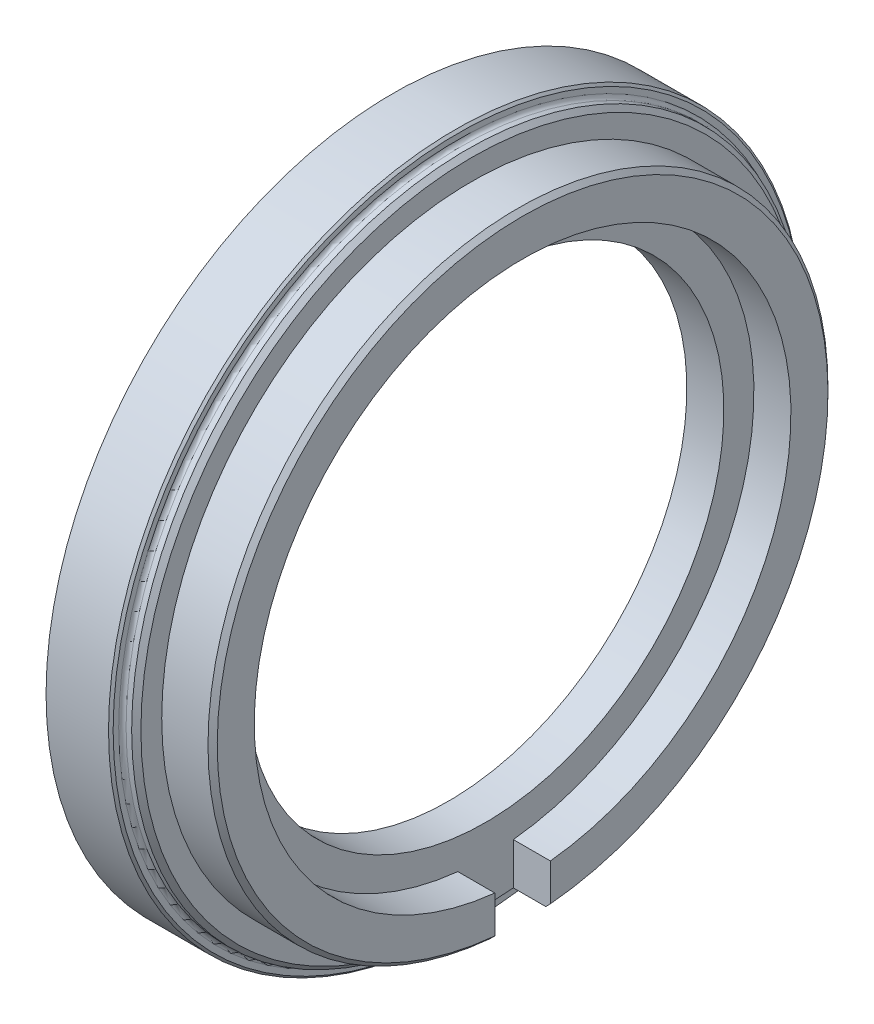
ISO-10303-21;
HEADER;
FILE_DESCRIPTION(('STEP AP214'),'2;1');
FILE_NAME('part.step','',(''),(''),'','','');
FILE_SCHEMA(('AUTOMOTIVE_DESIGN { 1 0 10303 214 1 1 1 1 }'));
ENDSEC;
DATA;
#1=APPLICATION_CONTEXT('core data for automotive mechanical design processes');
#2=APPLICATION_PROTOCOL_DEFINITION('international standard','automotive_design',2000,#1);
#3=PRODUCT_CONTEXT('',#1,'mechanical');
#4=PRODUCT('Part','Part','',(#3));
#5=PRODUCT_RELATED_PRODUCT_CATEGORY('part','',(#4));
#6=PRODUCT_DEFINITION_FORMATION('','',#4);
#7=PRODUCT_DEFINITION_CONTEXT('part definition',#1,'design');
#8=PRODUCT_DEFINITION('design','',#6,#7);
#9=PRODUCT_DEFINITION_SHAPE('','',#8);
#10=(LENGTH_UNIT() NAMED_UNIT(*) SI_UNIT(.MILLI.,.METRE.));
#11=(NAMED_UNIT(*) PLANE_ANGLE_UNIT() SI_UNIT($,.RADIAN.));
#12=(NAMED_UNIT(*) SI_UNIT($,.STERADIAN.) SOLID_ANGLE_UNIT());
#13=UNCERTAINTY_MEASURE_WITH_UNIT(LENGTH_MEASURE(1.E-05),#10,'distance_accuracy_value','');
#14=(GEOMETRIC_REPRESENTATION_CONTEXT(3) GLOBAL_UNCERTAINTY_ASSIGNED_CONTEXT((#13)) GLOBAL_UNIT_ASSIGNED_CONTEXT((#10,
#11,#12)) REPRESENTATION_CONTEXT('',''));
#15=CARTESIAN_POINT('',(0.,0.,0.));
#16=DIRECTION('',(0.,0.,1.));
#17=DIRECTION('',(1.,0.,0.));
#18=AXIS2_PLACEMENT_3D('',#15,#16,#17);
#19=CARTESIAN_POINT('',(0.,0.,0.));
#20=DIRECTION('',(-1.,0.,0.));
#21=DIRECTION('',(0.,0.,1.));
#22=AXIS2_PLACEMENT_3D('',#19,#20,#21);
#23=CYLINDRICAL_SURFACE('',#22,36.25);
#24=CARTESIAN_POINT('',(8.99999999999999,0.,0.));
#25=DIRECTION('',(-1.,0.,0.));
#26=DIRECTION('',(0.,0.,1.));
#27=AXIS2_PLACEMENT_3D('',#24,#25,#26);
#28=CIRCLE('',#27,36.25);
#29=CARTESIAN_POINT('',(8.99999999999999,0.,36.25));
#30=VERTEX_POINT('',#29);
#31=EDGE_CURVE('E94',#30,#30,#28,.F.);
#32=ORIENTED_EDGE('',*,*,#31,.F.);
#33=EDGE_LOOP('',(#32));
#34=FACE_BOUND('',#33,.T.);
#35=CARTESIAN_POINT('',(8.39999999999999,0.,0.));
#36=DIRECTION('',(-1.,0.,0.));
#37=DIRECTION('',(0.,0.,1.));
#38=AXIS2_PLACEMENT_3D('',#35,#36,#37);
#39=CIRCLE('',#38,36.25);
#40=CARTESIAN_POINT('',(8.39999999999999,0.,36.25));
#41=VERTEX_POINT('',#40);
#42=EDGE_CURVE('E340',#41,#41,#39,.F.);
#43=ORIENTED_EDGE('',*,*,#42,.T.);
#44=EDGE_LOOP('',(#43));
#45=FACE_BOUND('',#44,.T.);
#46=ADVANCED_FACE('F16',(#34,#45),#23,.T.);
#47=CARTESIAN_POINT('',(8.39999999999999,0.,0.));
#48=DIRECTION('',(-1.,0.,0.));
#49=DIRECTION('',(0.,0.,1.));
#50=AXIS2_PLACEMENT_3D('',#47,#48,#49);
#51=TOROIDAL_SURFACE('',#50,36.65,0.4);
#52=CARTESIAN_POINT('',(7.99999999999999,0.,0.));
#53=DIRECTION('',(1.,0.,0.));
#54=DIRECTION('',(0.,0.,-1.));
#55=AXIS2_PLACEMENT_3D('',#52,#53,#54);
#56=CIRCLE('',#55,36.65);
#57=CARTESIAN_POINT('',(7.99999999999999,0.,-36.65));
#58=VERTEX_POINT('',#57);
#59=CARTESIAN_POINT('',(7.99999999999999,0.,36.65));
#60=VERTEX_POINT('',#59);
#61=EDGE_CURVE('E87',#58,#60,#56,.T.);
#62=ORIENTED_EDGE('',*,*,#61,.T.);
#63=CARTESIAN_POINT('',(7.99999999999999,0.,0.));
#64=DIRECTION('',(1.,0.,0.));
#65=DIRECTION('',(0.,0.,1.));
#66=AXIS2_PLACEMENT_3D('',#63,#64,#65);
#67=CIRCLE('',#66,36.65);
#68=EDGE_CURVE('E90',#60,#58,#67,.T.);
#69=ORIENTED_EDGE('',*,*,#68,.T.);
#70=EDGE_LOOP('',(#62,#69));
#71=FACE_BOUND('',#70,.T.);
#72=ORIENTED_EDGE('',*,*,#42,.F.);
#73=EDGE_LOOP('',(#72));
#74=FACE_BOUND('',#73,.T.);
#75=ADVANCED_FACE('F98',(#71,#74),#51,.F.);
#76=CARTESIAN_POINT('',(8.99999999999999,0.,0.));
#77=DIRECTION('',(-1.,0.,0.));
#78=DIRECTION('',(0.,0.,1.));
#79=AXIS2_PLACEMENT_3D('',#76,#77,#78);
#80=CONICAL_SURFACE('',#79,36.25,0.78539816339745);
#81=CARTESIAN_POINT('',(9.49999999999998,0.,0.));
#82=DIRECTION('',(-1.,0.,0.));
#83=DIRECTION('',(0.,0.,1.));
#84=AXIS2_PLACEMENT_3D('',#81,#82,#83);
#85=CIRCLE('',#84,35.75);
#86=CARTESIAN_POINT('',(9.49999999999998,0.,35.75));
#87=VERTEX_POINT('',#86);
#88=EDGE_CURVE('E261',#87,#87,#85,.T.);
#89=ORIENTED_EDGE('',*,*,#88,.T.);
#90=EDGE_LOOP('',(#89));
#91=FACE_BOUND('',#90,.T.);
#92=ORIENTED_EDGE('',*,*,#31,.T.);
#93=EDGE_LOOP('',(#92));
#94=FACE_BOUND('',#93,.T.);
#95=ADVANCED_FACE('F116',(#91,#94),#80,.T.);
#96=CARTESIAN_POINT('',(7.99999999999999,36.25,0.));
#97=DIRECTION('',(-1.,0.,0.));
#98=DIRECTION('',(0.,0.,1.));
#99=AXIS2_PLACEMENT_3D('',#96,#97,#98);
#100=PLANE('',#99);
#101=CARTESIAN_POINT('',(7.99999999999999,0.,0.));
#102=DIRECTION('',(-1.,0.,0.));
#103=DIRECTION('',(0.,0.,1.));
#104=AXIS2_PLACEMENT_3D('',#101,#102,#103);
#105=CIRCLE('',#104,37.25);
#106=CARTESIAN_POINT('',(7.99999999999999,0.,37.25));
#107=VERTEX_POINT('',#106);
#108=EDGE_CURVE('E257',#107,#107,#105,.T.);
#109=ORIENTED_EDGE('',*,*,#108,.F.);
#110=EDGE_LOOP('',(#109));
#111=FACE_BOUND('',#110,.T.);
#112=ORIENTED_EDGE('',*,*,#68,.F.);
#113=ORIENTED_EDGE('',*,*,#61,.F.);
#114=EDGE_LOOP('',(#112,#113));
#115=FACE_BOUND('',#114,.T.);
#116=ADVANCED_FACE('F92',(#111,#115),#100,.F.);
#117=CARTESIAN_POINT('',(14.5,0.,0.));
#118=DIRECTION('',(-1.,0.,0.));
#119=DIRECTION('',(0.,0.,1.));
#120=AXIS2_PLACEMENT_3D('',#117,#118,#119);
#121=CONICAL_SURFACE('',#120,33.5,0.785398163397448);
#122=CARTESIAN_POINT('',(14.5,0.,0.));
#123=DIRECTION('',(-1.,0.,0.));
#124=DIRECTION('',(0.,0.,1.));
#125=AXIS2_PLACEMENT_3D('',#122,#123,#124);
#126=CIRCLE('',#125,33.5);
#127=CARTESIAN_POINT('',(14.5,-33.3654012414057,3.));
#128=VERTEX_POINT('',#127);
#129=CARTESIAN_POINT('',(14.5,-33.3654012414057,-3.));
#130=VERTEX_POINT('',#129);
#131=EDGE_CURVE('E74',#128,#130,#126,.T.);
#132=ORIENTED_EDGE('',*,*,#131,.F.);
#133=CARTESIAN_POINT('',(14.5,-33.3654012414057,3.));
#134=CARTESIAN_POINT('',(14.5833359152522,-33.2817291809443,3.));
#135=CARTESIAN_POINT('',(14.6666705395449,-33.198055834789,3.));
#136=CARTESIAN_POINT('',(14.8333372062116,-33.0307065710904,3.));
#137=CARTESIAN_POINT('',(14.9166692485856,-32.9470306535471,3.));
#138=CARTESIAN_POINT('',(15.,-32.86335345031,3.));
#139=B_SPLINE_CURVE_WITH_KNOTS('',3,(#133,#134,#135,#136,#137,#138),.UNSPECIFIED.,.F.,.F.,(4,2,
4),(0.,0.354278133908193,0.708556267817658),.UNSPECIFIED.);
#140=CARTESIAN_POINT('',(15.,-32.86335345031,3.));
#141=VERTEX_POINT('',#140);
#142=EDGE_CURVE('E149',#128,#141,#139,.T.);
#143=ORIENTED_EDGE('',*,*,#142,.T.);
#144=CARTESIAN_POINT('',(15.,0.,0.));
#145=DIRECTION('',(-1.,0.,0.));
#146=DIRECTION('',(0.,0.,1.));
#147=AXIS2_PLACEMENT_3D('',#144,#145,#146);
#148=CIRCLE('',#147,33.);
#149=CARTESIAN_POINT('',(15.,-32.86335345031,-3.));
#150=VERTEX_POINT('',#149);
#151=EDGE_CURVE('E260',#141,#150,#148,.T.);
#152=ORIENTED_EDGE('',*,*,#151,.T.);
#153=CARTESIAN_POINT('',(15.,-32.86335345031,-3.));
#154=CARTESIAN_POINT('',(14.9166692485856,-32.9470306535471,-3.));
#155=CARTESIAN_POINT('',(14.8333372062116,-33.0307065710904,-3.));
#156=CARTESIAN_POINT('',(14.6666705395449,-33.198055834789,-3.));
#157=CARTESIAN_POINT('',(14.5833359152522,-33.2817291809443,-3.));
#158=CARTESIAN_POINT('',(14.5,-33.3654012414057,-3.));
#159=B_SPLINE_CURVE_WITH_KNOTS('',3,(#153,#154,#155,#156,#157,#158),.UNSPECIFIED.,.F.,.F.,(4,2,
4),(0.,0.354278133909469,0.708556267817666),.UNSPECIFIED.);
#160=EDGE_CURVE('E66',#150,#130,#159,.T.);
#161=ORIENTED_EDGE('',*,*,#160,.T.);
#162=EDGE_LOOP('',(#132,#143,#152,#161));
#163=FACE_BOUND('',#162,.T.);
#164=ADVANCED_FACE('F124',(#163),#121,.T.);
#165=CARTESIAN_POINT('',(9.49999999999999,33.5,0.));
#166=DIRECTION('',(-1.,0.,0.));
#167=DIRECTION('',(0.,0.,1.));
#168=AXIS2_PLACEMENT_3D('',#165,#166,#167);
#169=PLANE('',#168);
#170=CARTESIAN_POINT('',(9.49999999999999,0.,0.));
#171=DIRECTION('',(-1.,0.,0.));
#172=DIRECTION('',(0.,0.,1.));
#173=AXIS2_PLACEMENT_3D('',#170,#171,#172);
#174=CIRCLE('',#173,33.5);
#175=CARTESIAN_POINT('',(9.49999999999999,0.,33.5));
#176=VERTEX_POINT('',#175);
#177=EDGE_CURVE('E253',#176,#176,#174,.F.);
#178=ORIENTED_EDGE('',*,*,#177,.F.);
#179=EDGE_LOOP('',(#178));
#180=FACE_BOUND('',#179,.T.);
#181=ORIENTED_EDGE('',*,*,#88,.F.);
#182=EDGE_LOOP('',(#181));
#183=FACE_BOUND('',#182,.T.);
#184=ADVANCED_FACE('F144',(#180,#183),#169,.F.);
#185=CARTESIAN_POINT('',(15.,29.,0.));
#186=DIRECTION('',(-1.,0.,0.));
#187=DIRECTION('',(0.,0.,1.));
#188=AXIS2_PLACEMENT_3D('',#185,#186,#187);
#189=PLANE('',#188);
#190=DIRECTION('',(0.,-1.,0.));
#191=VECTOR('',#190,1.);
#192=CARTESIAN_POINT('',(15.,-19.1439897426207,3.));
#193=LINE('',#192,#191);
#194=CARTESIAN_POINT('',(15.,-28.8444102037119,2.99999999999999));
#195=VERTEX_POINT('',#194);
#196=EDGE_CURVE('E268',#141,#195,#193,.F.);
#197=ORIENTED_EDGE('',*,*,#196,.T.);
#198=CARTESIAN_POINT('',(15.,0.,0.));
#199=DIRECTION('',(-1.,0.,0.));
#200=DIRECTION('',(0.,0.,1.));
#201=AXIS2_PLACEMENT_3D('',#198,#199,#200);
#202=CIRCLE('',#201,29.);
#203=CARTESIAN_POINT('',(15.,-28.8444102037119,-3.));
#204=VERTEX_POINT('',#203);
#205=EDGE_CURVE('E250',#195,#204,#202,.T.);
#206=ORIENTED_EDGE('',*,*,#205,.T.);
#207=DIRECTION('',(0.,1.,0.));
#208=VECTOR('',#207,1.);
#209=CARTESIAN_POINT('',(15.,-19.1439897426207,-3.));
#210=LINE('',#209,#208);
#211=EDGE_CURVE('E276',#204,#150,#210,.F.);
#212=ORIENTED_EDGE('',*,*,#211,.T.);
#213=ORIENTED_EDGE('',*,*,#151,.F.);
#214=EDGE_LOOP('',(#197,#206,#212,#213));
#215=FACE_BOUND('',#214,.T.);
#216=ADVANCED_FACE('F181',(#215),#189,.F.);
#217=CARTESIAN_POINT('',(7.75000000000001,0.,0.));
#218=DIRECTION('',(-1.,0.,0.));
#219=DIRECTION('',(0.,0.,1.));
#220=AXIS2_PLACEMENT_3D('',#217,#218,#219);
#221=CONICAL_SURFACE('',#220,37.5,0.785398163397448);
#222=ORIENTED_EDGE('',*,*,#108,.T.);
#223=EDGE_LOOP('',(#222));
#224=FACE_BOUND('',#223,.T.);
#225=CARTESIAN_POINT('',(7.75000000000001,0.,0.));
#226=DIRECTION('',(-1.,0.,0.));
#227=DIRECTION('',(0.,0.,1.));
#228=AXIS2_PLACEMENT_3D('',#225,#226,#227);
#229=CIRCLE('',#228,37.5);
#230=CARTESIAN_POINT('',(7.75000000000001,0.,37.5));
#231=VERTEX_POINT('',#230);
#232=EDGE_CURVE('E249',#231,#231,#229,.T.);
#233=ORIENTED_EDGE('',*,*,#232,.F.);
#234=EDGE_LOOP('',(#233));
#235=FACE_BOUND('',#234,.T.);
#236=ADVANCED_FACE('F179',(#224,#235),#221,.T.);
#237=CARTESIAN_POINT('',(0.,0.,0.));
#238=DIRECTION('',(-1.,0.,0.));
#239=DIRECTION('',(0.,0.,1.));
#240=AXIS2_PLACEMENT_3D('',#237,#238,#239);
#241=CYLINDRICAL_SURFACE('',#240,33.5);
#242=ORIENTED_EDGE('',*,*,#131,.T.);
#243=DIRECTION('',(1.,0.,0.));
#244=VECTOR('',#243,1.);
#245=CARTESIAN_POINT('',(-10.4202598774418,-33.3654012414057,-3.));
#246=LINE('',#245,#244);
#247=CARTESIAN_POINT('',(11.,-33.3654012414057,-3.));
#248=VERTEX_POINT('',#247);
#249=EDGE_CURVE('E279',#130,#248,#246,.F.);
#250=ORIENTED_EDGE('',*,*,#249,.T.);
#251=CARTESIAN_POINT('',(11.,0.,0.));
#252=DIRECTION('',(-1.,0.,0.));
#253=DIRECTION('',(0.,0.,1.));
#254=AXIS2_PLACEMENT_3D('',#251,#252,#253);
#255=CIRCLE('',#254,33.5);
#256=CARTESIAN_POINT('',(11.,-33.3654012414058,3.));
#257=VERTEX_POINT('',#256);
#258=EDGE_CURVE('E243',#248,#257,#255,.T.);
#259=ORIENTED_EDGE('',*,*,#258,.T.);
#260=DIRECTION('',(1.,0.,0.));
#261=VECTOR('',#260,1.);
#262=CARTESIAN_POINT('',(-10.4202598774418,-33.3654012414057,3.));
#263=LINE('',#262,#261);
#264=EDGE_CURVE('E256',#257,#128,#263,.T.);
#265=ORIENTED_EDGE('',*,*,#264,.T.);
#266=EDGE_LOOP('',(#242,#250,#259,#265));
#267=FACE_BOUND('',#266,.T.);
#268=ORIENTED_EDGE('',*,*,#177,.T.);
#269=EDGE_LOOP('',(#268));
#270=FACE_BOUND('',#269,.T.);
#271=ADVANCED_FACE('F175',(#267,#270),#241,.T.);
#272=CARTESIAN_POINT('',(-10.4202598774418,-19.1439897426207,3.));
#273=DIRECTION('',(0.,0.,1.));
#274=DIRECTION('',(0.,-1.,0.));
#275=AXIS2_PLACEMENT_3D('',#272,#273,#274);
#276=PLANE('',#275);
#277=ORIENTED_EDGE('',*,*,#142,.F.);
#278=ORIENTED_EDGE('',*,*,#264,.F.);
#279=DIRECTION('',(0.,1.,0.));
#280=VECTOR('',#279,1.);
#281=CARTESIAN_POINT('',(11.,29.,3.));
#282=LINE('',#281,#280);
#283=CARTESIAN_POINT('',(11.,-28.8444102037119,2.99999999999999));
#284=VERTEX_POINT('',#283);
#285=EDGE_CURVE('E242',#257,#284,#282,.T.);
#286=ORIENTED_EDGE('',*,*,#285,.T.);
#287=DIRECTION('',(-1.,0.,0.));
#288=VECTOR('',#287,1.);
#289=CARTESIAN_POINT('',(0.,-28.8444102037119,2.99999999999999));
#290=LINE('',#289,#288);
#291=EDGE_CURVE('E252',#284,#195,#290,.F.);
#292=ORIENTED_EDGE('',*,*,#291,.T.);
#293=ORIENTED_EDGE('',*,*,#196,.F.);
#294=EDGE_LOOP('',(#277,#278,#286,#292,#293));
#295=FACE_BOUND('',#294,.T.);
#296=ADVANCED_FACE('F170',(#295),#276,.F.);
#297=CARTESIAN_POINT('',(0.,0.,0.));
#298=DIRECTION('',(-1.,0.,0.));
#299=DIRECTION('',(0.,0.,1.));
#300=AXIS2_PLACEMENT_3D('',#297,#298,#299);
#301=CYLINDRICAL_SURFACE('',#300,29.);
#302=ORIENTED_EDGE('',*,*,#205,.F.);
#303=ORIENTED_EDGE('',*,*,#291,.F.);
#304=CARTESIAN_POINT('',(11.,0.,0.));
#305=DIRECTION('',(-1.,0.,0.));
#306=DIRECTION('',(0.,0.,1.));
#307=AXIS2_PLACEMENT_3D('',#304,#305,#306);
#308=CIRCLE('',#307,29.);
#309=CARTESIAN_POINT('',(11.,-28.8444102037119,-3.));
#310=VERTEX_POINT('',#309);
#311=EDGE_CURVE('E239',#284,#310,#308,.T.);
#312=ORIENTED_EDGE('',*,*,#311,.T.);
#313=DIRECTION('',(1.,0.,0.));
#314=VECTOR('',#313,1.);
#315=CARTESIAN_POINT('',(-10.4202598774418,-28.8444102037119,-3.));
#316=LINE('',#315,#314);
#317=EDGE_CURVE('E35',#310,#204,#316,.T.);
#318=ORIENTED_EDGE('',*,*,#317,.T.);
#319=EDGE_LOOP('',(#302,#303,#312,#318));
#320=FACE_BOUND('',#319,.T.);
#321=ADVANCED_FACE('F166',(#320),#301,.F.);
#322=CARTESIAN_POINT('',(-10.4202598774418,-19.1439897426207,-3.));
#323=DIRECTION('',(0.,0.,-1.));
#324=DIRECTION('',(0.,1.,0.));
#325=AXIS2_PLACEMENT_3D('',#322,#323,#324);
#326=PLANE('',#325);
#327=ORIENTED_EDGE('',*,*,#249,.F.);
#328=ORIENTED_EDGE('',*,*,#160,.F.);
#329=ORIENTED_EDGE('',*,*,#211,.F.);
#330=ORIENTED_EDGE('',*,*,#317,.F.);
#331=DIRECTION('',(0.,1.,0.));
#332=VECTOR('',#331,1.);
#333=CARTESIAN_POINT('',(11.,29.,-3.));
#334=LINE('',#333,#332);
#335=EDGE_CURVE('E238',#310,#248,#334,.F.);
#336=ORIENTED_EDGE('',*,*,#335,.T.);
#337=EDGE_LOOP('',(#327,#328,#329,#330,#336));
#338=FACE_BOUND('',#337,.T.);
#339=ADVANCED_FACE('F160',(#338),#326,.F.);
#340=CARTESIAN_POINT('',(0.,0.,0.));
#341=DIRECTION('',(-1.,0.,0.));
#342=DIRECTION('',(0.,0.,1.));
#343=AXIS2_PLACEMENT_3D('',#340,#341,#342);
#344=CYLINDRICAL_SURFACE('',#343,37.5);
#345=ORIENTED_EDGE('',*,*,#232,.T.);
#346=EDGE_LOOP('',(#345));
#347=FACE_BOUND('',#346,.T.);
#348=CARTESIAN_POINT('',(5.64999999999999,-37.5,0.));
#349=CARTESIAN_POINT('',(5.6499961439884,-37.4999995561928,-0.092555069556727));
#350=CARTESIAN_POINT('',(5.64218055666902,-37.4996534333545,-0.185234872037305));
#351=CARTESIAN_POINT('',(5.61109828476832,-37.4983053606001,-0.368097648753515));
#352=CARTESIAN_POINT('',(5.58779864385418,-37.4973020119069,-0.458274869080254));
#353=CARTESIAN_POINT('',(5.52641270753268,-37.4947529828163,-0.633369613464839));
#354=CARTESIAN_POINT('',(5.48833918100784,-37.4932077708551,-0.718291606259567));
#355=CARTESIAN_POINT('',(5.39850757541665,-37.4897495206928,-0.880494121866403));
#356=CARTESIAN_POINT('',(5.34675587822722,-37.4878366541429,-0.957778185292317));
#357=CARTESIAN_POINT('',(5.23097992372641,-37.4838561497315,-1.10262908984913));
#358=CARTESIAN_POINT('',(5.16694590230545,-37.4817883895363,-1.17018812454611));
#359=CARTESIAN_POINT('',(5.02843952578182,-37.4777321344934,-1.29360627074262));
#360=CARTESIAN_POINT('',(4.95396625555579,-37.4757436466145,-1.34946435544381));
#361=CARTESIAN_POINT('',(4.79666505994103,-37.4720695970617,-1.44790762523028));
#362=CARTESIAN_POINT('',(4.71383406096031,-37.4703841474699,-1.49048790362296));
#363=CARTESIAN_POINT('',(4.54219106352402,-37.4675074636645,-1.56113476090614));
#364=CARTESIAN_POINT('',(4.45337915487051,-37.4663162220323,-1.58920155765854));
#365=CARTESIAN_POINT('',(4.27235591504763,-37.4645632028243,-1.63000775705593));
#366=CARTESIAN_POINT('',(4.18014683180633,-37.4640010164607,-1.64275711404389));
#367=CARTESIAN_POINT('',(3.99489551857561,-37.4635682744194,-1.65259721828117));
#368=CARTESIAN_POINT('',(3.90185329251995,-37.4636977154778,-1.64968803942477));
#369=CARTESIAN_POINT('',(3.71764547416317,-37.4646332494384,-1.62830201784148));
#370=CARTESIAN_POINT('',(3.62647861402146,-37.4654388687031,-1.60983607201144));
#371=CARTESIAN_POINT('',(3.44853913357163,-37.4676352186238,-1.55787727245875));
#372=CARTESIAN_POINT('',(3.36176657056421,-37.4690259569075,-1.52438422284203));
#373=CARTESIAN_POINT('',(3.19504179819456,-37.4722363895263,-1.44330813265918));
#374=CARTESIAN_POINT('',(3.11509225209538,-37.4740562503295,-1.39571962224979));
#375=CARTESIAN_POINT('',(2.96431957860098,-37.4779194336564,-1.28781183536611));
#376=CARTESIAN_POINT('',(2.89349572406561,-37.4799627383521,-1.22749357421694));
#377=CARTESIAN_POINT('',(2.76292650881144,-37.4840443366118,-1.09578928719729));
#378=CARTESIAN_POINT('',(2.7031884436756,-37.486082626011,-1.02439602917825));
#379=CARTESIAN_POINT('',(2.59651605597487,-37.4899241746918,-0.872549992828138));
#380=CARTESIAN_POINT('',(2.54958777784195,-37.4917273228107,-0.792092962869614));
#381=CARTESIAN_POINT('',(2.46987400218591,-37.4948955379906,-0.6243786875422));
#382=CARTESIAN_POINT('',(2.4371006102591,-37.4962602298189,-0.537115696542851));
#383=CARTESIAN_POINT('',(2.38674125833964,-37.4983927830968,-0.358439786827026));
#384=CARTESIAN_POINT('',(2.3691229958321,-37.4991619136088,-0.267036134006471));
#385=CARTESIAN_POINT('',(2.35619993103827,-37.4997276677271,-0.145873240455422));
#386=CARTESIAN_POINT('',(2.35387659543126,-37.4998295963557,-0.116750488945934));
#387=CARTESIAN_POINT('',(2.35077602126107,-37.4999658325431,-0.0584226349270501));
#388=CARTESIAN_POINT('',(2.34999878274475,-37.5000001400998,-0.0292175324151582));
#389=CARTESIAN_POINT('',(2.35000385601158,-37.4999995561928,0.0925550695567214));
#390=CARTESIAN_POINT('',(2.35781944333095,-37.4996534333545,0.185234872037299));
#391=CARTESIAN_POINT('',(2.38890171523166,-37.4983053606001,0.36809764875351));
#392=CARTESIAN_POINT('',(2.4122013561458,-37.4973020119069,0.458274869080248));
#393=CARTESIAN_POINT('',(2.4735872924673,-37.4947529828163,0.633369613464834));
#394=CARTESIAN_POINT('',(2.51166081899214,-37.4932077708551,0.718291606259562));
#395=CARTESIAN_POINT('',(2.60149242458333,-37.4897495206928,0.880494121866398));
#396=CARTESIAN_POINT('',(2.65324412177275,-37.4878366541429,0.957778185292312));
#397=CARTESIAN_POINT('',(2.76902007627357,-37.4838561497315,1.10262908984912));
#398=CARTESIAN_POINT('',(2.83305409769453,-37.4817883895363,1.17018812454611));
#399=CARTESIAN_POINT('',(2.97156047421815,-37.4777321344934,1.29360627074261));
#400=CARTESIAN_POINT('',(3.04603374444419,-37.4757436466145,1.34946435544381));
#401=CARTESIAN_POINT('',(3.20333494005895,-37.4720695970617,1.44790762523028));
#402=CARTESIAN_POINT('',(3.28616593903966,-37.4703841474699,1.49048790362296));
#403=CARTESIAN_POINT('',(3.45780893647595,-37.4675074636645,1.56113476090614));
#404=CARTESIAN_POINT('',(3.54662084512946,-37.4663162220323,1.58920155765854));
#405=CARTESIAN_POINT('',(3.72764408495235,-37.4645632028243,1.63000775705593));
#406=CARTESIAN_POINT('',(3.81985316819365,-37.4640010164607,1.64275711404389));
#407=CARTESIAN_POINT('',(4.00510448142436,-37.4635682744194,1.65259721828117));
#408=CARTESIAN_POINT('',(4.09814670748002,-37.4636977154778,1.64968803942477));
#409=CARTESIAN_POINT('',(4.2823545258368,-37.4646332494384,1.62830201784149));
#410=CARTESIAN_POINT('',(4.37352138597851,-37.4654388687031,1.60983607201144));
#411=CARTESIAN_POINT('',(4.55146086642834,-37.4676352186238,1.55787727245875));
#412=CARTESIAN_POINT('',(4.63823342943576,-37.4690259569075,1.52438422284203));
#413=CARTESIAN_POINT('',(4.80495820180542,-37.4722363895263,1.44330813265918));
#414=CARTESIAN_POINT('',(4.88490774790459,-37.4740562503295,1.39571962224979));
#415=CARTESIAN_POINT('',(5.03568042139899,-37.4779194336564,1.28781183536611));
#416=CARTESIAN_POINT('',(5.10650427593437,-37.4799627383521,1.22749357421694));
#417=CARTESIAN_POINT('',(5.23707349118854,-37.4840443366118,1.09578928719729));
#418=CARTESIAN_POINT('',(5.29681155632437,-37.486082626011,1.02439602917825));
#419=CARTESIAN_POINT('',(5.4034839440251,-37.4899241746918,0.872549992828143));
#420=CARTESIAN_POINT('',(5.45041222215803,-37.4917273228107,0.792092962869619));
#421=CARTESIAN_POINT('',(5.53012599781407,-37.4948955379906,0.624378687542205));
#422=CARTESIAN_POINT('',(5.56289938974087,-37.4962602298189,0.537115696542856));
#423=CARTESIAN_POINT('',(5.61325874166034,-37.4983927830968,0.35843978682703));
#424=CARTESIAN_POINT('',(5.63087700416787,-37.4991619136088,0.267036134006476));
#425=CARTESIAN_POINT('',(5.64380006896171,-37.4997276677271,0.145873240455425));
#426=CARTESIAN_POINT('',(5.64612340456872,-37.4998295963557,0.116750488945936));
#427=CARTESIAN_POINT('',(5.64922397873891,-37.4999658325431,0.058422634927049));
#428=CARTESIAN_POINT('',(5.65000121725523,-37.5000001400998,0.0292175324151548));
#429=CARTESIAN_POINT('',(5.64999999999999,-37.5,0.));
#430=B_SPLINE_CURVE_WITH_KNOTS('',3,(#348,#349,#350,#351,#352,#353,#354,#355,#356,#357,#358,
#359,#360,#361,#362,#363,#364,#365,#366,#367,#368,#369,#370,#371,#372,#373,#374,#375,#376,#377,
#378,#379,#380,#381,#382,#383,#384,#385,#386,#387,#388,#389,#390,#391,#392,#393,#394,#395,#396,
#397,#398,#399,#400,#401,#402,#403,#404,#405,#406,#407,#408,#409,#410,#411,#412,#413,#414,#415,
#416,#417,#418,#419,#420,#421,#422,#423,#424,#425,#426,#427,#428,#429),.UNSPECIFIED.,.T.,.F.,(4,
2,2,2,2,2,2,2,2,2,2,2,2,2,2,2,2,2,2,2,2,2,2,2,2,2,2,2,2,2,2,2,2,2,2,2,2,2,2,2,4),(0.,
0.277554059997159,0.555700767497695,0.833607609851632,1.11138501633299,1.38938417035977,
1.66740770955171,1.94553386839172,2.22365585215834,2.50159699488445,2.77953682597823,
3.05728213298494,3.33503106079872,3.61288791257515,3.89072261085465,4.16873950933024,
4.44688736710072,4.72527263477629,5.00306305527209,5.09068056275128,5.17829807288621,
5.45585213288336,5.7339988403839,6.01190568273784,6.2896830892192,6.56768224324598,
6.84570578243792,7.12383194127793,7.40195392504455,7.67989506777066,7.95783489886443,
8.23558020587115,8.51332913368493,8.79118598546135,9.06902068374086,9.34703758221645,
9.62518543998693,9.90357070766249,10.1813611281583,10.2689786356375,10.3565961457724),.UNSPECIFIED.);
#431=CARTESIAN_POINT('',(5.64999999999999,-37.5,0.));
#432=VERTEX_POINT('',#431);
#433=EDGE_CURVE('E232',#432,#432,#430,.T.);
#434=ORIENTED_EDGE('',*,*,#433,.T.);
#435=EDGE_LOOP('',(#434));
#436=FACE_BOUND('',#435,.T.);
#437=CARTESIAN_POINT('',(0.99999999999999,0.,0.));
#438=DIRECTION('',(-1.,0.,0.));
#439=DIRECTION('',(0.,0.,1.));
#440=AXIS2_PLACEMENT_3D('',#437,#438,#439);
#441=CIRCLE('',#440,37.5);
#442=CARTESIAN_POINT('',(0.99999999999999,0.,37.5));
#443=VERTEX_POINT('',#442);
#444=EDGE_CURVE('E246',#443,#443,#441,.F.);
#445=ORIENTED_EDGE('',*,*,#444,.T.);
#446=EDGE_LOOP('',(#445));
#447=FACE_BOUND('',#446,.T.);
#448=ADVANCED_FACE('F165',(#347,#436,#447),#344,.T.);
#449=CARTESIAN_POINT('',(0.999999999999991,37.5,0.));
#450=DIRECTION('',(1.,0.,0.));
#451=DIRECTION('',(0.,0.,-1.));
#452=AXIS2_PLACEMENT_3D('',#449,#450,#451);
#453=PLANE('',#452);
#454=ORIENTED_EDGE('',*,*,#444,.F.);
#455=EDGE_LOOP('',(#454));
#456=FACE_BOUND('',#455,.T.);
#457=CARTESIAN_POINT('',(0.999999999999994,0.,0.));
#458=DIRECTION('',(-1.,0.,0.));
#459=DIRECTION('',(0.,0.,1.));
#460=AXIS2_PLACEMENT_3D('',#457,#458,#459);
#461=CIRCLE('',#460,36.5);
#462=CARTESIAN_POINT('',(0.999999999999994,0.,36.5));
#463=VERTEX_POINT('',#462);
#464=EDGE_CURVE('E237',#463,#463,#461,.F.);
#465=ORIENTED_EDGE('',*,*,#464,.T.);
#466=EDGE_LOOP('',(#465));
#467=FACE_BOUND('',#466,.T.);
#468=ADVANCED_FACE('F421',(#456,#467),#453,.F.);
#469=CARTESIAN_POINT('',(13.5000000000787,-21.9203102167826,-21.9203102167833));
#470=DIRECTION('',(-1.,0.,0.));
#471=DIRECTION('',(0.,0.,1.));
#472=AXIS2_PLACEMENT_3D('',#469,#470,#471);
#473=CONICAL_SURFACE('',#472,1.24999999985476,1.02974425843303);
#474=CARTESIAN_POINT('',(14.2510757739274,-21.9203102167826,-21.9203102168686));
#475=VERTEX_POINT('',#474);
#476=VERTEX_LOOP('',#475);
#477=FACE_BOUND('',#476,.T.);
#478=CARTESIAN_POINT('',(13.5,-21.9203102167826,-21.9203102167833));
#479=DIRECTION('',(-1.,0.,0.));
#480=DIRECTION('',(0.,0.,1.));
#481=AXIS2_PLACEMENT_3D('',#478,#479,#480);
#482=CIRCLE('',#481,1.24999999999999);
#483=CARTESIAN_POINT('',(13.5,-21.9203102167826,-20.6703102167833));
#484=VERTEX_POINT('',#483);
#485=EDGE_CURVE('E284',#484,#484,#482,.T.);
#486=ORIENTED_EDGE('',*,*,#485,.T.);
#487=EDGE_LOOP('',(#486));
#488=FACE_BOUND('',#487,.T.);
#489=ADVANCED_FACE('F432',(#477,#488),#473,.F.);
#490=CARTESIAN_POINT('',(13.5000000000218,-21.9203102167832,21.9203102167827));
#491=DIRECTION('',(-1.,0.,0.));
#492=DIRECTION('',(0.,0.,1.));
#493=AXIS2_PLACEMENT_3D('',#490,#491,#492);
#494=CONICAL_SURFACE('',#493,1.2499999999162,1.02974425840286);
#495=CARTESIAN_POINT('',(14.2510757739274,-21.9203102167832,21.920310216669));
#496=VERTEX_POINT('',#495);
#497=VERTEX_LOOP('',#496);
#498=FACE_BOUND('',#497,.T.);
#499=CARTESIAN_POINT('',(13.5,-21.9203102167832,21.9203102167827));
#500=DIRECTION('',(-1.,0.,0.));
#501=DIRECTION('',(0.,0.,1.));
#502=AXIS2_PLACEMENT_3D('',#499,#500,#501);
#503=CIRCLE('',#502,1.24999999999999);
#504=CARTESIAN_POINT('',(13.5,-21.9203102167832,23.1703102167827));
#505=VERTEX_POINT('',#504);
#506=EDGE_CURVE('E287',#505,#505,#503,.T.);
#507=ORIENTED_EDGE('',*,*,#506,.T.);
#508=EDGE_LOOP('',(#507));
#509=FACE_BOUND('',#508,.T.);
#510=ADVANCED_FACE('F441',(#498,#509),#494,.F.);
#511=CARTESIAN_POINT('',(13.5000000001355,-8.02339039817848,29.943700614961));
#512=DIRECTION('',(-1.,0.,0.));
#513=DIRECTION('',(0.,-1.,0.));
#514=AXIS2_PLACEMENT_3D('',#511,#512,#513);
#515=CONICAL_SURFACE('',#514,1.24999999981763,1.02974425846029);
#516=CARTESIAN_POINT('',(14.2510757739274,-8.02339039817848,29.9437006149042));
#517=VERTEX_POINT('',#516);
#518=VERTEX_LOOP('',#517);
#519=FACE_BOUND('',#518,.T.);
#520=CARTESIAN_POINT('',(13.5,-8.02339039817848,29.943700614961));
#521=DIRECTION('',(-1.,0.,0.));
#522=DIRECTION('',(0.,0.,1.));
#523=AXIS2_PLACEMENT_3D('',#520,#521,#522);
#524=CIRCLE('',#523,1.24999999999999);
#525=CARTESIAN_POINT('',(13.5,-8.02339039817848,31.193700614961));
#526=VERTEX_POINT('',#525);
#527=EDGE_CURVE('E290',#526,#526,#524,.T.);
#528=ORIENTED_EDGE('',*,*,#527,.T.);
#529=EDGE_LOOP('',(#528));
#530=FACE_BOUND('',#529,.T.);
#531=ADVANCED_FACE('F450',(#519,#530),#515,.F.);
#532=CARTESIAN_POINT('',(13.5000000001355,8.02339039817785,29.9437006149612));
#533=DIRECTION('',(-1.,0.,0.));
#534=DIRECTION('',(0.,-1.,0.));
#535=AXIS2_PLACEMENT_3D('',#532,#533,#534);
#536=CONICAL_SURFACE('',#535,1.24999999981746,1.02974425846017);
#537=CARTESIAN_POINT('',(14.2510757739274,8.02339039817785,29.9437006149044));
#538=VERTEX_POINT('',#537);
#539=VERTEX_LOOP('',#538);
#540=FACE_BOUND('',#539,.T.);
#541=CARTESIAN_POINT('',(13.5,8.02339039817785,29.9437006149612));
#542=DIRECTION('',(-1.,0.,0.));
#543=DIRECTION('',(0.,0.,1.));
#544=AXIS2_PLACEMENT_3D('',#541,#542,#543);
#545=CIRCLE('',#544,1.24999999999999);
#546=CARTESIAN_POINT('',(13.5,8.02339039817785,31.1937006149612));
#547=VERTEX_POINT('',#546);
#548=EDGE_CURVE('E293',#547,#547,#545,.T.);
#549=ORIENTED_EDGE('',*,*,#548,.T.);
#550=EDGE_LOOP('',(#549));
#551=FACE_BOUND('',#550,.T.);
#552=ADVANCED_FACE('F460',(#540,#551),#536,.F.);
#553=CARTESIAN_POINT('',(13.5000000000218,21.9203102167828,21.9203102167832));
#554=DIRECTION('',(-1.,0.,0.));
#555=DIRECTION('',(0.,0.,1.));
#556=AXIS2_PLACEMENT_3D('',#553,#554,#555);
#557=CONICAL_SURFACE('',#556,1.24999999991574,1.02974425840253);
#558=CARTESIAN_POINT('',(14.2510757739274,21.9203102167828,21.9203102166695));
#559=VERTEX_POINT('',#558);
#560=VERTEX_LOOP('',#559);
#561=FACE_BOUND('',#560,.T.);
#562=CARTESIAN_POINT('',(13.5,21.9203102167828,21.9203102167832));
#563=DIRECTION('',(-1.,0.,0.));
#564=DIRECTION('',(0.,0.,1.));
#565=AXIS2_PLACEMENT_3D('',#562,#563,#564);
#566=CIRCLE('',#565,1.24999999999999);
#567=CARTESIAN_POINT('',(13.5,21.9203102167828,23.1703102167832));
#568=VERTEX_POINT('',#567);
#569=EDGE_CURVE('E296',#568,#568,#566,.T.);
#570=ORIENTED_EDGE('',*,*,#569,.T.);
#571=EDGE_LOOP('',(#570));
#572=FACE_BOUND('',#571,.T.);
#573=ADVANCED_FACE('F470',(#561,#572),#557,.F.);
#574=CARTESIAN_POINT('',(13.5000000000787,21.9203102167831,-21.9203102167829));
#575=DIRECTION('',(-1.,0.,0.));
#576=DIRECTION('',(0.,0.,1.));
#577=AXIS2_PLACEMENT_3D('',#574,#575,#576);
#578=CONICAL_SURFACE('',#577,1.24999999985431,1.0297442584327);
#579=CARTESIAN_POINT('',(14.2510757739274,21.9203102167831,-21.9203102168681));
#580=VERTEX_POINT('',#579);
#581=VERTEX_LOOP('',#580);
#582=FACE_BOUND('',#581,.T.);
#583=CARTESIAN_POINT('',(13.5,21.9203102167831,-21.9203102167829));
#584=DIRECTION('',(-1.,0.,0.));
#585=DIRECTION('',(0.,0.,1.));
#586=AXIS2_PLACEMENT_3D('',#583,#584,#585);
#587=CIRCLE('',#586,1.24999999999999);
#588=CARTESIAN_POINT('',(13.5,21.9203102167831,-20.6703102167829));
#589=VERTEX_POINT('',#588);
#590=EDGE_CURVE('E299',#589,#589,#587,.T.);
#591=ORIENTED_EDGE('',*,*,#590,.T.);
#592=EDGE_LOOP('',(#591));
#593=FACE_BOUND('',#592,.T.);
#594=ADVANCED_FACE('F480',(#582,#593),#578,.F.);
#595=CARTESIAN_POINT('',(13.5000000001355,8.02339039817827,-29.9437006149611));
#596=DIRECTION('',(-1.,0.,0.));
#597=DIRECTION('',(0.,-1.,0.));
#598=AXIS2_PLACEMENT_3D('',#595,#596,#597);
#599=CONICAL_SURFACE('',#598,1.24999999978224,1.02974425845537);
#600=CARTESIAN_POINT('',(14.2510757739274,8.02339039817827,-29.9437006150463));
#601=VERTEX_POINT('',#600);
#602=VERTEX_LOOP('',#601);
#603=FACE_BOUND('',#602,.T.);
#604=CARTESIAN_POINT('',(13.5,8.02339039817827,-29.9437006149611));
#605=DIRECTION('',(-1.,0.,0.));
#606=DIRECTION('',(0.,0.,1.));
#607=AXIS2_PLACEMENT_3D('',#604,#605,#606);
#608=CIRCLE('',#607,1.24999999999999);
#609=CARTESIAN_POINT('',(13.5,8.02339039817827,-28.6937006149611));
#610=VERTEX_POINT('',#609);
#611=EDGE_CURVE('E302',#610,#610,#608,.T.);
#612=ORIENTED_EDGE('',*,*,#611,.T.);
#613=EDGE_LOOP('',(#612));
#614=FACE_BOUND('',#613,.T.);
#615=ADVANCED_FACE('F490',(#603,#614),#599,.F.);
#616=CARTESIAN_POINT('',(13.5000000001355,-8.02339039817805,-29.9437006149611));
#617=DIRECTION('',(-1.,0.,0.));
#618=DIRECTION('',(0.,-1.,0.));
#619=AXIS2_PLACEMENT_3D('',#616,#617,#618);
#620=CONICAL_SURFACE('',#619,1.2499999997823,1.0297442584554);
#621=CARTESIAN_POINT('',(14.2510757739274,-8.02339039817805,-29.9437006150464));
#622=VERTEX_POINT('',#621);
#623=VERTEX_LOOP('',#622);
#624=FACE_BOUND('',#623,.T.);
#625=CARTESIAN_POINT('',(13.5,-8.02339039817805,-29.9437006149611));
#626=DIRECTION('',(-1.,0.,0.));
#627=DIRECTION('',(0.,0.,1.));
#628=AXIS2_PLACEMENT_3D('',#625,#626,#627);
#629=CIRCLE('',#628,1.24999999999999);
#630=CARTESIAN_POINT('',(13.5,-8.02339039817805,-28.6937006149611));
#631=VERTEX_POINT('',#630);
#632=EDGE_CURVE('E305',#631,#631,#629,.T.);
#633=ORIENTED_EDGE('',*,*,#632,.T.);
#634=EDGE_LOOP('',(#633));
#635=FACE_BOUND('',#634,.T.);
#636=ADVANCED_FACE('F500',(#624,#635),#620,.F.);
#637=CARTESIAN_POINT('',(11.,29.,0.));
#638=DIRECTION('',(-1.,0.,0.));
#639=DIRECTION('',(0.,0.,1.));
#640=AXIS2_PLACEMENT_3D('',#637,#638,#639);
#641=PLANE('',#640);
#642=CARTESIAN_POINT('',(11.,0.,0.));
#643=DIRECTION('',(-1.,0.,0.));
#644=DIRECTION('',(0.,0.,1.));
#645=AXIS2_PLACEMENT_3D('',#642,#643,#644);
#646=CIRCLE('',#645,25.75);
#647=CARTESIAN_POINT('',(11.,0.,25.75));
#648=VERTEX_POINT('',#647);
#649=EDGE_CURVE('E216',#648,#648,#646,.T.);
#650=ORIENTED_EDGE('',*,*,#649,.T.);
#651=EDGE_LOOP('',(#650));
#652=FACE_BOUND('',#651,.T.);
#653=ORIENTED_EDGE('',*,*,#311,.F.);
#654=ORIENTED_EDGE('',*,*,#285,.F.);
#655=ORIENTED_EDGE('',*,*,#258,.F.);
#656=ORIENTED_EDGE('',*,*,#335,.F.);
#657=EDGE_LOOP('',(#653,#654,#655,#656));
#658=FACE_BOUND('',#657,.T.);
#659=ADVANCED_FACE('F226',(#652,#658),#641,.F.);
#660=CARTESIAN_POINT('',(3.99999999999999,-29.2624042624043,0.));
#661=DIRECTION('',(0.,-1.,0.));
#662=DIRECTION('',(1.,0.,0.));
#663=AXIS2_PLACEMENT_3D('',#660,#661,#662);
#664=CYLINDRICAL_SURFACE('',#663,1.65);
#665=ORIENTED_EDGE('',*,*,#433,.F.);
#666=EDGE_LOOP('',(#665));
#667=FACE_BOUND('',#666,.T.);
#668=CARTESIAN_POINT('',(5.64999999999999,-35.5,0.));
#669=CARTESIAN_POINT('',(5.64999614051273,-35.4999995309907,-0.0925493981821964));
#670=CARTESIAN_POINT('',(5.64218150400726,-35.4996339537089,-0.185223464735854));
#671=CARTESIAN_POINT('',(5.61110319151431,-35.4982101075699,-0.368074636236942));
#672=CARTESIAN_POINT('',(5.58780657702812,-35.4971503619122,-0.45824598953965));
#673=CARTESIAN_POINT('',(5.52642915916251,-35.4944580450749,-0.633328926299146));
#674=CARTESIAN_POINT('',(5.48836117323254,-35.4928259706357,-0.718244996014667));
#675=CARTESIAN_POINT('',(5.39854313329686,-35.4891732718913,-0.880436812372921));
#676=CARTESIAN_POINT('',(5.34679944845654,-35.4871528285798,-0.957716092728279));
#677=CARTESIAN_POINT('',(5.23103749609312,-35.482948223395,-1.10256463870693));
#678=CARTESIAN_POINT('',(5.16700861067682,-35.480763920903,-1.17012541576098));
#679=CARTESIAN_POINT('',(5.02851220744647,-35.4764789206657,-1.29354833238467));
#680=CARTESIAN_POINT('',(4.9540437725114,-35.4743782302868,-1.34940944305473));
#681=CARTESIAN_POINT('',(4.79674741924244,-35.4704966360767,-1.44786247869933));
#682=CARTESIAN_POINT('',(4.71391603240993,-35.4687158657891,-1.49044886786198));
#683=CARTESIAN_POINT('',(4.54227020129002,-35.4656763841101,-1.56110748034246));
#684=CARTESIAN_POINT('',(4.45345584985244,-35.4644176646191,-1.58917992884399));
#685=CARTESIAN_POINT('',(4.27243288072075,-35.4625653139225,-1.62999474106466));
#686=CARTESIAN_POINT('',(4.18022677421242,-35.4619712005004,-1.6427482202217));
#687=CARTESIAN_POINT('',(3.99498050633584,-35.4615136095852,-1.65259734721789));
#688=CARTESIAN_POINT('',(3.90194034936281,-35.461650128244,-1.64969307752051));
#689=CARTESIAN_POINT('',(3.71774361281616,-35.4626379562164,-1.62831847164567));
#690=CARTESIAN_POINT('',(3.62658561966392,-35.4634887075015,-1.60986028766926));
#691=CARTESIAN_POINT('',(3.44866256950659,-35.4658082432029,-1.55792033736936));
#692=CARTESIAN_POINT('',(3.36189757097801,-35.4672770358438,-1.52443837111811));
#693=CARTESIAN_POINT('',(3.19518236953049,-35.4706678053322,-1.44338603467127));
#694=CARTESIAN_POINT('',(3.11523510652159,-35.4725899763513,-1.39580962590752));
#695=CARTESIAN_POINT('',(2.9644643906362,-35.4766704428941,-1.28792768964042));
#696=CARTESIAN_POINT('',(2.89364021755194,-35.4788287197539,-1.22762316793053));
#697=CARTESIAN_POINT('',(2.76306046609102,-35.4831403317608,-1.09594054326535));
#698=CARTESIAN_POINT('',(2.70331327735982,-35.4852936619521,-1.02455412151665));
#699=CARTESIAN_POINT('',(2.59662144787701,-35.4893521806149,-0.872719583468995));
#700=CARTESIAN_POINT('',(2.54968284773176,-35.4912572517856,-0.792267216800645));
#701=CARTESIAN_POINT('',(2.46994760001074,-35.4946047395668,-0.624559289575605));
#702=CARTESIAN_POINT('',(2.4371630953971,-35.496046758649,-0.537297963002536));
#703=CARTESIAN_POINT('',(2.38678172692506,-35.4983003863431,-0.358622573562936));
#704=CARTESIAN_POINT('',(2.36915256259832,-35.4991133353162,-0.267217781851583));
#705=CARTESIAN_POINT('',(2.35621269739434,-35.4997117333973,-0.146023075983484));
#706=CARTESIAN_POINT('',(2.35388457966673,-35.4998196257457,-0.116870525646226));
#707=CARTESIAN_POINT('',(2.35077762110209,-35.4999638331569,-0.0584828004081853));
#708=CARTESIAN_POINT('',(2.34999878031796,-35.5000001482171,-0.0292476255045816));
#709=CARTESIAN_POINT('',(2.35000385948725,-35.4999995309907,0.0925493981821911));
#710=CARTESIAN_POINT('',(2.35781849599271,-35.4996339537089,0.185223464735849));
#711=CARTESIAN_POINT('',(2.38889680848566,-35.4982101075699,0.368074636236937));
#712=CARTESIAN_POINT('',(2.41219342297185,-35.4971503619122,0.458245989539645));
#713=CARTESIAN_POINT('',(2.47357084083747,-35.4944580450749,0.633328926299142));
#714=CARTESIAN_POINT('',(2.51163882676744,-35.4928259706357,0.718244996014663));
#715=CARTESIAN_POINT('',(2.60145686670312,-35.4891732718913,0.880436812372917));
#716=CARTESIAN_POINT('',(2.65320055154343,-35.4871528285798,0.957716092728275));
#717=CARTESIAN_POINT('',(2.76896250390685,-35.482948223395,1.10256463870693));
#718=CARTESIAN_POINT('',(2.83299138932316,-35.480763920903,1.17012541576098));
#719=CARTESIAN_POINT('',(2.97148779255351,-35.4764789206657,1.29354833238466));
#720=CARTESIAN_POINT('',(3.04595622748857,-35.4743782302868,1.34940944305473));
#721=CARTESIAN_POINT('',(3.20325258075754,-35.4704966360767,1.44786247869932));
#722=CARTESIAN_POINT('',(3.28608396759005,-35.4687158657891,1.49044886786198));
#723=CARTESIAN_POINT('',(3.45772979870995,-35.4656763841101,1.56110748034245));
#724=CARTESIAN_POINT('',(3.54654415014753,-35.4644176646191,1.58917992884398));
#725=CARTESIAN_POINT('',(3.72756711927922,-35.4625653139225,1.62999474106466));
#726=CARTESIAN_POINT('',(3.81977322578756,-35.4619712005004,1.6427482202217));
#727=CARTESIAN_POINT('',(4.00501949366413,-35.4615136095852,1.65259734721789));
#728=CARTESIAN_POINT('',(4.09805965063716,-35.461650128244,1.64969307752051));
#729=CARTESIAN_POINT('',(4.28225638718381,-35.4626379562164,1.62831847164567));
#730=CARTESIAN_POINT('',(4.37341438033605,-35.4634887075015,1.60986028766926));
#731=CARTESIAN_POINT('',(4.55133743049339,-35.4658082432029,1.55792033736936));
#732=CARTESIAN_POINT('',(4.63810242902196,-35.4672770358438,1.52443837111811));
#733=CARTESIAN_POINT('',(4.80481763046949,-35.4706678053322,1.44338603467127));
#734=CARTESIAN_POINT('',(4.88476489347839,-35.4725899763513,1.39580962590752));
#735=CARTESIAN_POINT('',(5.03553560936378,-35.4766704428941,1.28792768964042));
#736=CARTESIAN_POINT('',(5.10635978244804,-35.4788287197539,1.22762316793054));
#737=CARTESIAN_POINT('',(5.23693953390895,-35.4831403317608,1.09594054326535));
#738=CARTESIAN_POINT('',(5.29668672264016,-35.4852936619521,1.02455412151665));
#739=CARTESIAN_POINT('',(5.40337855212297,-35.4893521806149,0.872719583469));
#740=CARTESIAN_POINT('',(5.45031715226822,-35.4912572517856,0.79226721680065));
#741=CARTESIAN_POINT('',(5.53005239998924,-35.4946047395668,0.62455928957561));
#742=CARTESIAN_POINT('',(5.56283690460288,-35.496046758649,0.537297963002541));
#743=CARTESIAN_POINT('',(5.61321827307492,-35.4983003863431,0.358622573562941));
#744=CARTESIAN_POINT('',(5.63084743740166,-35.4991133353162,0.267217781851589));
#745=CARTESIAN_POINT('',(5.64378730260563,-35.4997117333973,0.146023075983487));
#746=CARTESIAN_POINT('',(5.64611542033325,-35.4998196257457,0.116870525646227));
#747=CARTESIAN_POINT('',(5.64922237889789,-35.4999638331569,0.0584828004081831));
#748=CARTESIAN_POINT('',(5.65000121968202,-35.5000001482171,0.0292476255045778));
#749=CARTESIAN_POINT('',(5.64999999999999,-35.5,0.));
#750=B_SPLINE_CURVE_WITH_KNOTS('',3,(#668,#669,#670,#671,#672,#673,#674,#675,#676,#677,#678,
#679,#680,#681,#682,#683,#684,#685,#686,#687,#688,#689,#690,#691,#692,#693,#694,#695,#696,#697,
#698,#699,#700,#701,#702,#703,#704,#705,#706,#707,#708,#709,#710,#711,#712,#713,#714,#715,#716,
#717,#718,#719,#720,#721,#722,#723,#724,#725,#726,#727,#728,#729,#730,#731,#732,#733,#734,#735,
#736,#737,#738,#739,#740,#741,#742,#743,#744,#745,#746,#747,#748,#749),.UNSPECIFIED.,.T.,.F.,(4,
2,2,2,2,2,2,2,2,2,2,2,2,2,2,2,2,2,2,2,2,2,2,2,2,2,2,2,2,2,2,2,2,2,2,2,2,2,2,2,4),(0.,
0.277536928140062,0.55566622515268,0.833554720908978,1.11131402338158,1.38931447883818,
1.66733937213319,1.94548005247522,2.22361641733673,2.50155084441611,2.77948380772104,
3.05719982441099,3.33491953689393,3.61275840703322,3.89057533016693,4.16860181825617,
4.4467591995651,4.72515474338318,5.00295546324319,5.09066317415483,5.17837088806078,
5.45590781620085,5.73403711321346,6.01192560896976,6.28968491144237,6.56768536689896,
6.84571026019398,7.12385094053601,7.40198730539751,7.67992173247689,7.95785469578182,
8.23557071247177,8.51329042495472,8.791129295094,9.06894621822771,9.34697270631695,
9.62513008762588,9.90352563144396,10.181326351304,10.2690340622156,10.3567417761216),.UNSPECIFIED.);
#751=CARTESIAN_POINT('',(5.64999999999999,-35.5,0.));
#752=VERTEX_POINT('',#751);
#753=EDGE_CURVE('E208',#752,#752,#750,.T.);
#754=ORIENTED_EDGE('',*,*,#753,.T.);
#755=EDGE_LOOP('',(#754));
#756=FACE_BOUND('',#755,.T.);
#757=ADVANCED_FACE('F220',(#667,#756),#664,.F.);
#758=CARTESIAN_POINT('',(0.999999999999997,0.,0.));
#759=DIRECTION('',(-1.,0.,0.));
#760=DIRECTION('',(0.,0.,1.));
#761=AXIS2_PLACEMENT_3D('',#758,#759,#760);
#762=CONICAL_SURFACE('',#761,36.5,0.785398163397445);
#763=CARTESIAN_POINT('',(2.00000000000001,0.,0.));
#764=DIRECTION('',(-1.,0.,0.));
#765=DIRECTION('',(0.,0.,1.));
#766=AXIS2_PLACEMENT_3D('',#763,#764,#765);
#767=CIRCLE('',#766,35.5);
#768=CARTESIAN_POINT('',(2.00000000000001,0.,35.5));
#769=VERTEX_POINT('',#768);
#770=EDGE_CURVE('E215',#769,#769,#767,.F.);
#771=ORIENTED_EDGE('',*,*,#770,.T.);
#772=EDGE_LOOP('',(#771));
#773=FACE_BOUND('',#772,.T.);
#774=ORIENTED_EDGE('',*,*,#464,.F.);
#775=EDGE_LOOP('',(#774));
#776=FACE_BOUND('',#775,.T.);
#777=ADVANCED_FACE('F225',(#773,#776),#762,.F.);
#778=CARTESIAN_POINT('',(6.99999999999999,-21.9203102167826,-21.9203102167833));
#779=DIRECTION('',(-1.,0.,0.));
#780=DIRECTION('',(0.,0.,1.));
#781=AXIS2_PLACEMENT_3D('',#778,#779,#780);
#782=CYLINDRICAL_SURFACE('',#781,1.24999999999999);
#783=ORIENTED_EDGE('',*,*,#485,.F.);
#784=EDGE_LOOP('',(#783));
#785=FACE_BOUND('',#784,.T.);
#786=CARTESIAN_POINT('',(6.99999999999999,-21.9203102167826,-21.9203102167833));
#787=DIRECTION('',(-1.,0.,0.));
#788=DIRECTION('',(0.,0.,1.));
#789=AXIS2_PLACEMENT_3D('',#786,#787,#788);
#790=CIRCLE('',#789,1.24999999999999);
#791=CARTESIAN_POINT('',(6.99999999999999,-21.9203102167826,-20.6703102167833));
#792=VERTEX_POINT('',#791);
#793=EDGE_CURVE('E217',#792,#792,#790,.T.);
#794=ORIENTED_EDGE('',*,*,#793,.T.);
#795=EDGE_LOOP('',(#794));
#796=FACE_BOUND('',#795,.T.);
#797=ADVANCED_FACE('F532',(#785,#796),#782,.F.);
#798=CARTESIAN_POINT('',(6.99999999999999,-21.9203102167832,21.9203102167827));
#799=DIRECTION('',(-1.,0.,0.));
#800=DIRECTION('',(0.,0.,1.));
#801=AXIS2_PLACEMENT_3D('',#798,#799,#800);
#802=CYLINDRICAL_SURFACE('',#801,1.24999999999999);
#803=ORIENTED_EDGE('',*,*,#506,.F.);
#804=EDGE_LOOP('',(#803));
#805=FACE_BOUND('',#804,.T.);
#806=CARTESIAN_POINT('',(6.99999999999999,-21.9203102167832,21.9203102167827));
#807=DIRECTION('',(-1.,0.,0.));
#808=DIRECTION('',(0.,0.,1.));
#809=AXIS2_PLACEMENT_3D('',#806,#807,#808);
#810=CIRCLE('',#809,1.24999999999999);
#811=CARTESIAN_POINT('',(6.99999999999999,-21.9203102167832,23.1703102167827));
#812=VERTEX_POINT('',#811);
#813=EDGE_CURVE('E314',#812,#812,#810,.T.);
#814=ORIENTED_EDGE('',*,*,#813,.T.);
#815=EDGE_LOOP('',(#814));
#816=FACE_BOUND('',#815,.T.);
#817=ADVANCED_FACE('F541',(#805,#816),#802,.F.);
#818=CARTESIAN_POINT('',(6.99999999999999,-8.02339039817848,29.943700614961));
#819=DIRECTION('',(-1.,0.,0.));
#820=DIRECTION('',(0.,0.,1.));
#821=AXIS2_PLACEMENT_3D('',#818,#819,#820);
#822=CYLINDRICAL_SURFACE('',#821,1.24999999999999);
#823=ORIENTED_EDGE('',*,*,#527,.F.);
#824=EDGE_LOOP('',(#823));
#825=FACE_BOUND('',#824,.T.);
#826=CARTESIAN_POINT('',(6.99999999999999,-8.02339039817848,29.943700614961));
#827=DIRECTION('',(-1.,0.,0.));
#828=DIRECTION('',(0.,0.,1.));
#829=AXIS2_PLACEMENT_3D('',#826,#827,#828);
#830=CIRCLE('',#829,1.24999999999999);
#831=CARTESIAN_POINT('',(6.99999999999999,-8.02339039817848,31.193700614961));
#832=VERTEX_POINT('',#831);
#833=EDGE_CURVE('E318',#832,#832,#830,.T.);
#834=ORIENTED_EDGE('',*,*,#833,.T.);
#835=EDGE_LOOP('',(#834));
#836=FACE_BOUND('',#835,.T.);
#837=ADVANCED_FACE('F550',(#825,#836),#822,.F.);
#838=CARTESIAN_POINT('',(6.99999999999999,8.02339039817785,29.9437006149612));
#839=DIRECTION('',(-1.,0.,0.));
#840=DIRECTION('',(0.,0.,1.));
#841=AXIS2_PLACEMENT_3D('',#838,#839,#840);
#842=CYLINDRICAL_SURFACE('',#841,1.24999999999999);
#843=ORIENTED_EDGE('',*,*,#548,.F.);
#844=EDGE_LOOP('',(#843));
#845=FACE_BOUND('',#844,.T.);
#846=CARTESIAN_POINT('',(6.99999999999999,8.02339039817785,29.9437006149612));
#847=DIRECTION('',(-1.,0.,0.));
#848=DIRECTION('',(0.,0.,1.));
#849=AXIS2_PLACEMENT_3D('',#846,#847,#848);
#850=CIRCLE('',#849,1.24999999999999);
#851=CARTESIAN_POINT('',(6.99999999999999,8.02339039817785,31.1937006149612));
#852=VERTEX_POINT('',#851);
#853=EDGE_CURVE('E322',#852,#852,#850,.T.);
#854=ORIENTED_EDGE('',*,*,#853,.T.);
#855=EDGE_LOOP('',(#854));
#856=FACE_BOUND('',#855,.T.);
#857=ADVANCED_FACE('F560',(#845,#856),#842,.F.);
#858=CARTESIAN_POINT('',(6.99999999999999,21.9203102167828,21.9203102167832));
#859=DIRECTION('',(-1.,0.,0.));
#860=DIRECTION('',(0.,0.,1.));
#861=AXIS2_PLACEMENT_3D('',#858,#859,#860);
#862=CYLINDRICAL_SURFACE('',#861,1.24999999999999);
#863=ORIENTED_EDGE('',*,*,#569,.F.);
#864=EDGE_LOOP('',(#863));
#865=FACE_BOUND('',#864,.T.);
#866=CARTESIAN_POINT('',(6.99999999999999,21.9203102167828,21.9203102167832));
#867=DIRECTION('',(-1.,0.,0.));
#868=DIRECTION('',(0.,0.,1.));
#869=AXIS2_PLACEMENT_3D('',#866,#867,#868);
#870=CIRCLE('',#869,1.24999999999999);
#871=CARTESIAN_POINT('',(6.99999999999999,21.9203102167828,23.1703102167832));
#872=VERTEX_POINT('',#871);
#873=EDGE_CURVE('E327',#872,#872,#870,.T.);
#874=ORIENTED_EDGE('',*,*,#873,.T.);
#875=EDGE_LOOP('',(#874));
#876=FACE_BOUND('',#875,.T.);
#877=ADVANCED_FACE('F570',(#865,#876),#862,.F.);
#878=CARTESIAN_POINT('',(6.99999999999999,21.9203102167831,-21.9203102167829));
#879=DIRECTION('',(-1.,0.,0.));
#880=DIRECTION('',(0.,0.,1.));
#881=AXIS2_PLACEMENT_3D('',#878,#879,#880);
#882=CYLINDRICAL_SURFACE('',#881,1.24999999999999);
#883=ORIENTED_EDGE('',*,*,#590,.F.);
#884=EDGE_LOOP('',(#883));
#885=FACE_BOUND('',#884,.T.);
#886=CARTESIAN_POINT('',(6.99999999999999,21.9203102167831,-21.9203102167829));
#887=DIRECTION('',(-1.,0.,0.));
#888=DIRECTION('',(0.,0.,1.));
#889=AXIS2_PLACEMENT_3D('',#886,#887,#888);
#890=CIRCLE('',#889,1.24999999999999);
#891=CARTESIAN_POINT('',(6.99999999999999,21.9203102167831,-20.6703102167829));
#892=VERTEX_POINT('',#891);
#893=EDGE_CURVE('E330',#892,#892,#890,.T.);
#894=ORIENTED_EDGE('',*,*,#893,.T.);
#895=EDGE_LOOP('',(#894));
#896=FACE_BOUND('',#895,.T.);
#897=ADVANCED_FACE('F580',(#885,#896),#882,.F.);
#898=CARTESIAN_POINT('',(6.99999999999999,8.02339039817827,-29.9437006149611));
#899=DIRECTION('',(-1.,0.,0.));
#900=DIRECTION('',(0.,0.,1.));
#901=AXIS2_PLACEMENT_3D('',#898,#899,#900);
#902=CYLINDRICAL_SURFACE('',#901,1.24999999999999);
#903=ORIENTED_EDGE('',*,*,#611,.F.);
#904=EDGE_LOOP('',(#903));
#905=FACE_BOUND('',#904,.T.);
#906=CARTESIAN_POINT('',(6.99999999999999,8.02339039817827,-29.9437006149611));
#907=DIRECTION('',(-1.,0.,0.));
#908=DIRECTION('',(0.,0.,1.));
#909=AXIS2_PLACEMENT_3D('',#906,#907,#908);
#910=CIRCLE('',#909,1.24999999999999);
#911=CARTESIAN_POINT('',(6.99999999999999,8.02339039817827,-28.6937006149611));
#912=VERTEX_POINT('',#911);
#913=EDGE_CURVE('E333',#912,#912,#910,.T.);
#914=ORIENTED_EDGE('',*,*,#913,.T.);
#915=EDGE_LOOP('',(#914));
#916=FACE_BOUND('',#915,.T.);
#917=ADVANCED_FACE('F590',(#905,#916),#902,.F.);
#918=CARTESIAN_POINT('',(6.99999999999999,-8.02339039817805,-29.9437006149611));
#919=DIRECTION('',(-1.,0.,0.));
#920=DIRECTION('',(0.,0.,1.));
#921=AXIS2_PLACEMENT_3D('',#918,#919,#920);
#922=CYLINDRICAL_SURFACE('',#921,1.24999999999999);
#923=ORIENTED_EDGE('',*,*,#632,.F.);
#924=EDGE_LOOP('',(#923));
#925=FACE_BOUND('',#924,.T.);
#926=CARTESIAN_POINT('',(6.99999999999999,-8.02339039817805,-29.9437006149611));
#927=DIRECTION('',(-1.,0.,0.));
#928=DIRECTION('',(0.,0.,1.));
#929=AXIS2_PLACEMENT_3D('',#926,#927,#928);
#930=CIRCLE('',#929,1.24999999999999);
#931=CARTESIAN_POINT('',(6.99999999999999,-8.02339039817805,-28.6937006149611));
#932=VERTEX_POINT('',#931);
#933=EDGE_CURVE('E336',#932,#932,#930,.T.);
#934=ORIENTED_EDGE('',*,*,#933,.T.);
#935=EDGE_LOOP('',(#934));
#936=FACE_BOUND('',#935,.T.);
#937=ADVANCED_FACE('F600',(#925,#936),#922,.F.);
#938=CARTESIAN_POINT('',(0.,0.,0.));
#939=DIRECTION('',(-1.,0.,0.));
#940=DIRECTION('',(0.,0.,1.));
#941=AXIS2_PLACEMENT_3D('',#938,#939,#940);
#942=CYLINDRICAL_SURFACE('',#941,25.75);
#943=ORIENTED_EDGE('',*,*,#649,.F.);
#944=EDGE_LOOP('',(#943));
#945=FACE_BOUND('',#944,.T.);
#946=CARTESIAN_POINT('',(6.99999999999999,0.,0.));
#947=DIRECTION('',(-1.,0.,0.));
#948=DIRECTION('',(0.,0.,1.));
#949=AXIS2_PLACEMENT_3D('',#946,#947,#948);
#950=CIRCLE('',#949,25.75);
#951=CARTESIAN_POINT('',(6.99999999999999,0.,25.75));
#952=VERTEX_POINT('',#951);
#953=EDGE_CURVE('E26',#952,#952,#950,.T.);
#954=ORIENTED_EDGE('',*,*,#953,.T.);
#955=EDGE_LOOP('',(#954));
#956=FACE_BOUND('',#955,.T.);
#957=ADVANCED_FACE('F199',(#945,#956),#942,.F.);
#958=CARTESIAN_POINT('',(0.,0.,0.));
#959=DIRECTION('',(-1.,0.,0.));
#960=DIRECTION('',(0.,0.,1.));
#961=AXIS2_PLACEMENT_3D('',#958,#959,#960);
#962=CYLINDRICAL_SURFACE('',#961,35.5);
#963=CARTESIAN_POINT('',(6.99999999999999,0.,0.));
#964=DIRECTION('',(-1.,0.,0.));
#965=DIRECTION('',(0.,0.,1.));
#966=AXIS2_PLACEMENT_3D('',#963,#964,#965);
#967=CIRCLE('',#966,35.5);
#968=CARTESIAN_POINT('',(6.99999999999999,0.,35.5));
#969=VERTEX_POINT('',#968);
#970=EDGE_CURVE('E11',#969,#969,#967,.F.);
#971=ORIENTED_EDGE('',*,*,#970,.T.);
#972=EDGE_LOOP('',(#971));
#973=FACE_BOUND('',#972,.T.);
#974=ORIENTED_EDGE('',*,*,#770,.F.);
#975=EDGE_LOOP('',(#974));
#976=FACE_BOUND('',#975,.T.);
#977=ORIENTED_EDGE('',*,*,#753,.F.);
#978=EDGE_LOOP('',(#977));
#979=FACE_BOUND('',#978,.T.);
#980=ADVANCED_FACE('F193',(#973,#976,#979),#962,.F.);
#981=CARTESIAN_POINT('',(6.99999999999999,35.5,0.));
#982=DIRECTION('',(1.,0.,0.));
#983=DIRECTION('',(0.,0.,-1.));
#984=AXIS2_PLACEMENT_3D('',#981,#982,#983);
#985=PLANE('',#984);
#986=ORIENTED_EDGE('',*,*,#970,.F.);
#987=EDGE_LOOP('',(#986));
#988=FACE_BOUND('',#987,.T.);
#989=ORIENTED_EDGE('',*,*,#953,.F.);
#990=EDGE_LOOP('',(#989));
#991=FACE_BOUND('',#990,.T.);
#992=ORIENTED_EDGE('',*,*,#933,.F.);
#993=EDGE_LOOP('',(#992));
#994=FACE_BOUND('',#993,.T.);
#995=ORIENTED_EDGE('',*,*,#913,.F.);
#996=EDGE_LOOP('',(#995));
#997=FACE_BOUND('',#996,.T.);
#998=ORIENTED_EDGE('',*,*,#893,.F.);
#999=EDGE_LOOP('',(#998));
#1000=FACE_BOUND('',#999,.T.);
#1001=ORIENTED_EDGE('',*,*,#873,.F.);
#1002=EDGE_LOOP('',(#1001));
#1003=FACE_BOUND('',#1002,.T.);
#1004=ORIENTED_EDGE('',*,*,#853,.F.);
#1005=EDGE_LOOP('',(#1004));
#1006=FACE_BOUND('',#1005,.T.);
#1007=ORIENTED_EDGE('',*,*,#833,.F.);
#1008=EDGE_LOOP('',(#1007));
#1009=FACE_BOUND('',#1008,.T.);
#1010=ORIENTED_EDGE('',*,*,#813,.F.);
#1011=EDGE_LOOP('',(#1010));
#1012=FACE_BOUND('',#1011,.T.);
#1013=ORIENTED_EDGE('',*,*,#793,.F.);
#1014=EDGE_LOOP('',(#1013));
#1015=FACE_BOUND('',#1014,.T.);
#1016=ADVANCED_FACE('F191',(#988,#991,#994,#997,#1000,#1003,#1006,#1009,#1012,#1015),#985,.F.);
#1017=CLOSED_SHELL('',(#46,#75,#95,#116,#164,#184,#216,#236,#271,#296,#321,#339,#448,#468,#489,
#510,#531,#552,#573,#594,#615,#636,#659,#757,#777,#797,#817,#837,#857,#877,#897,#917,#937,#957,
#980,#1016));
#1018=MANIFOLD_SOLID_BREP('B1',#1017);
#1019=ADVANCED_BREP_SHAPE_REPRESENTATION('',(#18,#1018),#14);
#1020=SHAPE_DEFINITION_REPRESENTATION(#9,#1019);
ENDSEC;
END-ISO-10303-21;
